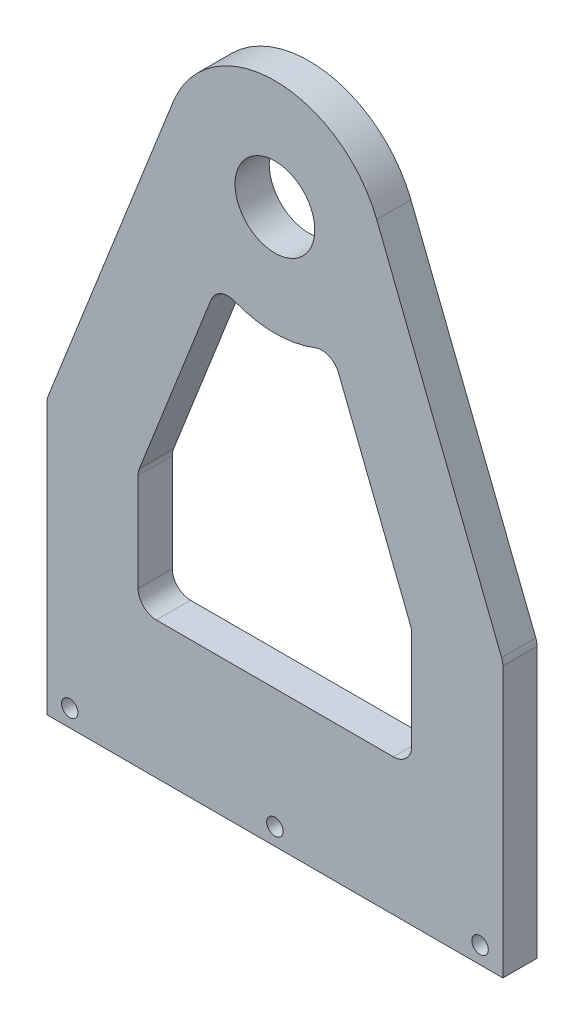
from build123d import *

# Parameters (mm, degrees)
SKETCH1_R           = 5.55625
BOSS_EXTRUDE1_DEPTH = 4.7625
SKETCH2_R           = 1.143
CUT_EXTRUDE1_DEPTH  = 98.778056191
CUT_EXTRUDE2_DEPTH  = 98.778056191
FILLET3_R           = 2.54


with BuildPart() as part:
    # Sketch1 → Boss-Extrude1 (new body)
    with BuildSketch(Plane.XY):
        with BuildLine():
            Line((-31.75, 0), (31.75, 0))
            Line((31.75, 0), (31.75, 38.1))
            Line((31.75, 38.1), (14.179447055, 82.702714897))
            ThreePointArc((14.179447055, 82.702714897), (0, 92.35694), (-14.179447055, 82.702714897))
            Line((-14.179447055, 82.702714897), (-31.75, 38.1))
            Line((-31.75, 38.1), (-31.75, 0))
        make_face()
        with Locations(Location((0, 77.11694, 0), (0, 0, 180))):
            Circle(SKETCH1_R, mode=Mode.SUBTRACT)
    extrude(amount=BOSS_EXTRUDE1_DEPTH)

    # Sketch2 → Cut-Extrude1 (cut, through all)
    with BuildSketch(Plane.XY.offset(4.7625)):
        with Locations((-28.575, 2.38125)):
            Circle(SKETCH2_R)
        with Locations((28.575, 2.38125)):
            Circle(SKETCH2_R)
        with Locations((0, 2.38125)):
            Circle(SKETCH2_R)
    extrude(amount=-CUT_EXTRUDE1_DEPTH, mode=Mode.SUBTRACT)

    # Sketch3 → Cut-Extrude2 (cut, through all)
    with BuildSketch(Plane.XY.offset(4.7625)):
        with BuildLine():
            Line((-19.05, 35.688692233), (-19.05, 19.05))
            Line((-19.05, 19.05), (19.05, 19.05))
            Line((19.05, 19.05), (19.05, 35.688692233))
            Line((19.05, 35.688692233), (7.870889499, 64.066779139))
            ThreePointArc((7.870889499, 64.066779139), (0, 61.87694), (-7.870889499, 64.066779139))
            Line((-7.870889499, 64.066779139), (-19.05, 35.688692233))
        make_face()
    extrude(amount=-CUT_EXTRUDE2_DEPTH, mode=Mode.SUBTRACT)

    # Fillet3
    fillet3_edges = [part.edges().sort_by_distance(p)[0] for p in [
        (-31.75, 38.1, 2.38125),
        (31.75, 38.1, 2.38125),
        (-19.05, 35.688692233, 2.38125),
        (-7.870889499, 64.066779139, 2.38125),
        (7.870889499, 64.066779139, 2.38125),
        (19.05, 35.688692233, 2.38125),
        (19.05, 19.05, 2.38125),
        (-19.05, 19.05, 2.38125),
    ]]
    fillet(fillet3_edges, radius=FILLET3_R)


solid = part.part
